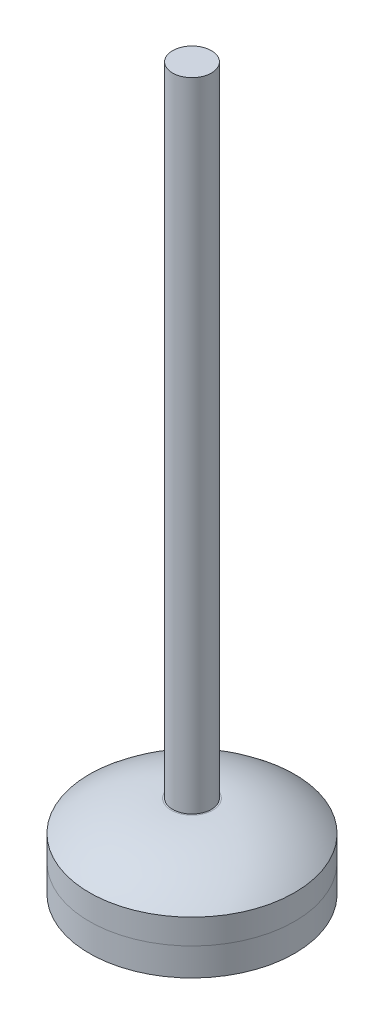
ISO-10303-21;
HEADER;
FILE_DESCRIPTION(('STEP AP214'),'2;1');
FILE_NAME('part.step','',(''),(''),'','','');
FILE_SCHEMA(('AUTOMOTIVE_DESIGN { 1 0 10303 214 1 1 1 1 }'));
ENDSEC;
DATA;
#1=APPLICATION_CONTEXT('core data for automotive mechanical design processes');
#2=APPLICATION_PROTOCOL_DEFINITION('international standard','automotive_design',2000,#1);
#3=PRODUCT_CONTEXT('',#1,'mechanical');
#4=PRODUCT('Part','Part','',(#3));
#5=PRODUCT_RELATED_PRODUCT_CATEGORY('part','',(#4));
#6=PRODUCT_DEFINITION_FORMATION('','',#4);
#7=PRODUCT_DEFINITION_CONTEXT('part definition',#1,'design');
#8=PRODUCT_DEFINITION('design','',#6,#7);
#9=PRODUCT_DEFINITION_SHAPE('','',#8);
#10=(LENGTH_UNIT() NAMED_UNIT(*) SI_UNIT(.MILLI.,.METRE.));
#11=(NAMED_UNIT(*) PLANE_ANGLE_UNIT() SI_UNIT($,.RADIAN.));
#12=(NAMED_UNIT(*) SI_UNIT($,.STERADIAN.) SOLID_ANGLE_UNIT());
#13=UNCERTAINTY_MEASURE_WITH_UNIT(LENGTH_MEASURE(1.E-05),#10,'distance_accuracy_value','');
#14=(GEOMETRIC_REPRESENTATION_CONTEXT(3) GLOBAL_UNCERTAINTY_ASSIGNED_CONTEXT((#13)) GLOBAL_UNIT_ASSIGNED_CONTEXT((#10,
#11,#12)) REPRESENTATION_CONTEXT('',''));
#15=CARTESIAN_POINT('',(0.,0.,0.));
#16=DIRECTION('',(0.,0.,1.));
#17=DIRECTION('',(1.,0.,0.));
#18=AXIS2_PLACEMENT_3D('',#15,#16,#17);
#19=CARTESIAN_POINT('',(0.,-10.,0.));
#20=DIRECTION('',(0.,1.,0.));
#21=DIRECTION('',(-1.,0.,0.));
#22=AXIS2_PLACEMENT_3D('',#19,#20,#21);
#23=CYLINDRICAL_SURFACE('',#22,37.);
#24=CARTESIAN_POINT('',(0.,-10.,0.));
#25=DIRECTION('',(0.,-1.,0.));
#26=DIRECTION('',(1.,0.,0.));
#27=AXIS2_PLACEMENT_3D('',#24,#25,#26);
#28=CIRCLE('',#27,37.);
#29=CARTESIAN_POINT('',(37.0000000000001,-10.,0.));
#30=VERTEX_POINT('',#29);
#31=EDGE_CURVE('E11',#30,#30,#28,.T.);
#32=ORIENTED_EDGE('',*,*,#31,.F.);
#33=EDGE_LOOP('',(#32));
#34=FACE_BOUND('',#33,.T.);
#35=CARTESIAN_POINT('',(0.,0.,0.));
#36=DIRECTION('',(0.,-1.,0.));
#37=DIRECTION('',(1.,0.,0.));
#38=AXIS2_PLACEMENT_3D('',#35,#36,#37);
#39=CIRCLE('',#38,37.);
#40=CARTESIAN_POINT('',(37.0000000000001,0.,0.));
#41=VERTEX_POINT('',#40);
#42=EDGE_CURVE('E54',#41,#41,#39,.T.);
#43=ORIENTED_EDGE('',*,*,#42,.T.);
#44=EDGE_LOOP('',(#43));
#45=FACE_BOUND('',#44,.T.);
#46=ADVANCED_FACE('F47',(#34,#45),#23,.T.);
#47=CARTESIAN_POINT('',(0.,-10.,0.));
#48=DIRECTION('',(0.,-1.,0.));
#49=DIRECTION('',(1.,0.,0.));
#50=AXIS2_PLACEMENT_3D('',#47,#48,#49);
#51=PLANE('',#50);
#52=ORIENTED_EDGE('',*,*,#31,.T.);
#53=EDGE_LOOP('',(#52));
#54=FACE_BOUND('',#53,.T.);
#55=ADVANCED_FACE('F64',(#54),#51,.T.);
#56=CARTESIAN_POINT('',(0.,0.,0.));
#57=DIRECTION('',(0.,-1.,0.));
#58=DIRECTION('',(1.,0.,0.));
#59=AXIS2_PLACEMENT_3D('',#56,#57,#58);
#60=PLANE('',#59);
#61=ORIENTED_EDGE('',*,*,#42,.F.);
#62=EDGE_LOOP('',(#61));
#63=FACE_BOUND('',#62,.T.);
#64=ADVANCED_FACE('F62',(#63),#60,.F.);
#65=CLOSED_SHELL('',(#46,#55,#64));
#66=MANIFOLD_SOLID_BREP('B2',#65);
#67=CARTESIAN_POINT('',(7.50000000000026,20.,0.));
#68=DIRECTION('',(0.,-1.,0.));
#69=DIRECTION('',(1.,0.,0.));
#70=AXIS2_PLACEMENT_3D('',#67,#68,#69);
#71=PLANE('',#70);
#72=CARTESIAN_POINT('',(0.,20.,0.));
#73=DIRECTION('',(0.,1.,0.));
#74=DIRECTION('',(-1.,0.,0.));
#75=AXIS2_PLACEMENT_3D('',#72,#73,#74);
#76=CIRCLE('',#75,7.5);
#77=CARTESIAN_POINT('',(-7.50000000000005,20.,0.));
#78=VERTEX_POINT('',#77);
#79=EDGE_CURVE('E99',#78,#78,#76,.T.);
#80=ORIENTED_EDGE('',*,*,#79,.T.);
#81=EDGE_LOOP('',(#80));
#82=FACE_BOUND('',#81,.T.);
#83=CARTESIAN_POINT('',(0.,20.,0.));
#84=DIRECTION('',(0.,-1.,0.));
#85=DIRECTION('',(1.,0.,0.));
#86=AXIS2_PLACEMENT_3D('',#83,#84,#85);
#87=CIRCLE('',#86,7.);
#88=CARTESIAN_POINT('',(6.99999999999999,20.,0.));
#89=VERTEX_POINT('',#88);
#90=EDGE_CURVE('E46',#89,#89,#87,.F.);
#91=ORIENTED_EDGE('',*,*,#90,.F.);
#92=EDGE_LOOP('',(#91));
#93=FACE_BOUND('',#92,.T.);
#94=ADVANCED_FACE('F92',(#82,#93),#71,.F.);
#95=CARTESIAN_POINT('',(3.88578058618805E-13,-25.0568181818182,-1.66533453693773E-12));
#96=DIRECTION('',(0.,1.,0.));
#97=DIRECTION('',(-1.,0.,0.));
#98=AXIS2_PLACEMENT_3D('',#95,#96,#97);
#99=DEGENERATE_TOROIDAL_SURFACE('',#98,7.5,45.0568181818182,.T.);
#100=ORIENTED_EDGE('',*,*,#79,.F.);
#101=EDGE_LOOP('',(#100));
#102=FACE_BOUND('',#101,.T.);
#103=CARTESIAN_POINT('',(0.,9.00000000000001,0.));
#104=DIRECTION('',(0.,1.,0.));
#105=DIRECTION('',(-1.,0.,0.));
#106=AXIS2_PLACEMENT_3D('',#103,#104,#105);
#107=CIRCLE('',#106,37.);
#108=CARTESIAN_POINT('',(-37.0000000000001,9.00000000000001,0.));
#109=VERTEX_POINT('',#108);
#110=EDGE_CURVE('E106',#109,#109,#107,.T.);
#111=ORIENTED_EDGE('',*,*,#110,.T.);
#112=EDGE_LOOP('',(#111));
#113=FACE_BOUND('',#112,.T.);
#114=ADVANCED_FACE('F135',(#102,#113),#99,.T.);
#115=CARTESIAN_POINT('',(0.,20.,0.));
#116=DIRECTION('',(0.,1.,0.));
#117=DIRECTION('',(-1.,0.,0.));
#118=AXIS2_PLACEMENT_3D('',#115,#116,#117);
#119=CYLINDRICAL_SURFACE('',#118,37.);
#120=ORIENTED_EDGE('',*,*,#110,.F.);
#121=EDGE_LOOP('',(#120));
#122=FACE_BOUND('',#121,.T.);
#123=CARTESIAN_POINT('',(0.,0.,0.));
#124=DIRECTION('',(0.,1.,0.));
#125=DIRECTION('',(-1.,0.,0.));
#126=AXIS2_PLACEMENT_3D('',#123,#124,#125);
#127=CIRCLE('',#126,37.);
#128=CARTESIAN_POINT('',(-37.0000000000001,0.,0.));
#129=VERTEX_POINT('',#128);
#130=EDGE_CURVE('E111',#129,#129,#127,.T.);
#131=ORIENTED_EDGE('',*,*,#130,.T.);
#132=EDGE_LOOP('',(#131));
#133=FACE_BOUND('',#132,.T.);
#134=ADVANCED_FACE('F131',(#122,#133),#119,.T.);
#135=CARTESIAN_POINT('',(0.,0.,0.));
#136=DIRECTION('',(0.,1.,0.));
#137=DIRECTION('',(-1.,0.,0.));
#138=AXIS2_PLACEMENT_3D('',#135,#136,#137);
#139=PLANE('',#138);
#140=ORIENTED_EDGE('',*,*,#130,.F.);
#141=EDGE_LOOP('',(#140));
#142=FACE_BOUND('',#141,.T.);
#143=ADVANCED_FACE('F124',(#142),#139,.F.);
#144=CARTESIAN_POINT('',(0.,250.,0.));
#145=DIRECTION('',(0.,-1.,0.));
#146=DIRECTION('',(1.,0.,0.));
#147=AXIS2_PLACEMENT_3D('',#144,#145,#146);
#148=CYLINDRICAL_SURFACE('',#147,7.);
#149=CARTESIAN_POINT('',(0.,250.,0.));
#150=DIRECTION('',(0.,1.,0.));
#151=DIRECTION('',(-1.,0.,0.));
#152=AXIS2_PLACEMENT_3D('',#149,#150,#151);
#153=CIRCLE('',#152,7.);
#154=CARTESIAN_POINT('',(-7.00000000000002,250.,0.));
#155=VERTEX_POINT('',#154);
#156=EDGE_CURVE('E116',#155,#155,#153,.T.);
#157=ORIENTED_EDGE('',*,*,#156,.F.);
#158=EDGE_LOOP('',(#157));
#159=FACE_BOUND('',#158,.T.);
#160=ORIENTED_EDGE('',*,*,#90,.T.);
#161=EDGE_LOOP('',(#160));
#162=FACE_BOUND('',#161,.T.);
#163=ADVANCED_FACE('F122',(#159,#162),#148,.T.);
#164=CARTESIAN_POINT('',(0.,250.,0.));
#165=DIRECTION('',(0.,1.,0.));
#166=DIRECTION('',(-1.,0.,0.));
#167=AXIS2_PLACEMENT_3D('',#164,#165,#166);
#168=PLANE('',#167);
#169=ORIENTED_EDGE('',*,*,#156,.T.);
#170=EDGE_LOOP('',(#169));
#171=FACE_BOUND('',#170,.T.);
#172=ADVANCED_FACE('F120',(#171),#168,.T.);
#173=CLOSED_SHELL('',(#94,#114,#134,#143,#163,#172));
#174=MANIFOLD_SOLID_BREP('B6',#173);
#175=ADVANCED_BREP_SHAPE_REPRESENTATION('',(#18,#66,#174),#14);
#176=SHAPE_DEFINITION_REPRESENTATION(#9,#175);
ENDSEC;
END-ISO-10303-21;
